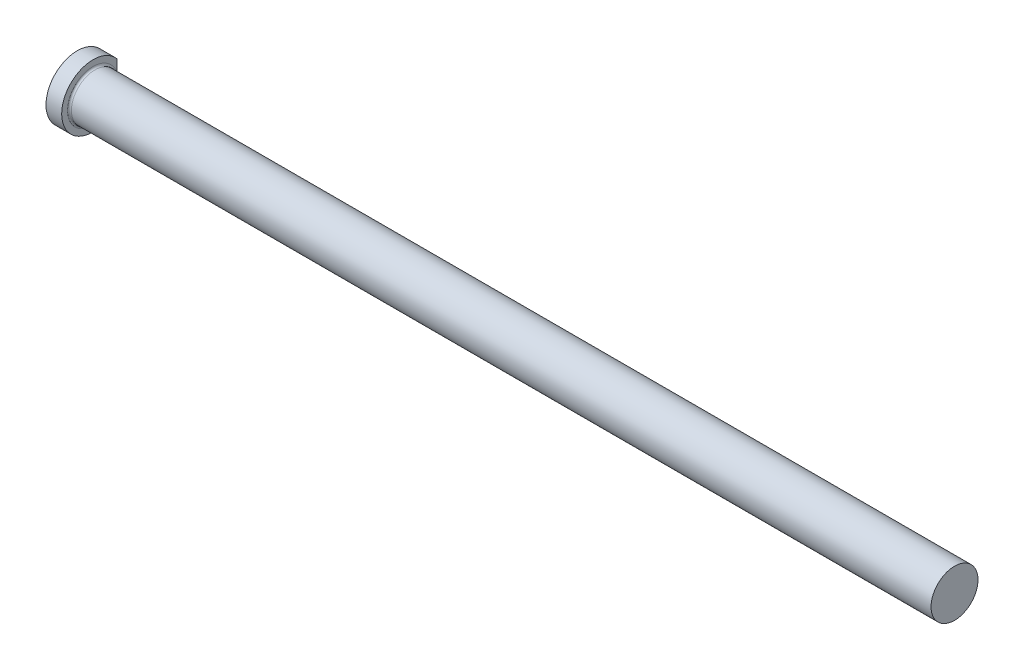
from build123d import *


with BuildPart() as part:
    # Sketch1 → PIN (revolve)
    with BuildSketch(Plane.XY, mode=Mode.PRIVATE) as pin_sk:
        with BuildLine():
            Line((0, 0), (0, 12.7))
            Line((0, 12.7), (6.35, 12.7))
            Line((6.35, 12.7), (6.35, 10.30605))
            ThreePointArc((6.35, 10.30605), (6.58062412, 9.74927412), (7.1374, 9.51865))
            Line((7.1374, 9.51865), (355.6, 9.51865))
            Line((355.6, 9.51865), (355.6, 0))
            Line((355.6, 0), (0, 0))
        make_face()
    revolve(pin_sk.sketch.rotate(Axis((355.6, 0, 0), (-1, 0, 0)), 180), axis=Axis((355.6, 0, 0), (-1, 0, 0)))

    # SurfaceCut1
    split(bisect_by=Plane(origin=(0, 0, -9.69645), x_dir=(-1, 0, 0), z_dir=(0, 0, -1)), keep=Keep.BOTTOM)


solid = part.part
